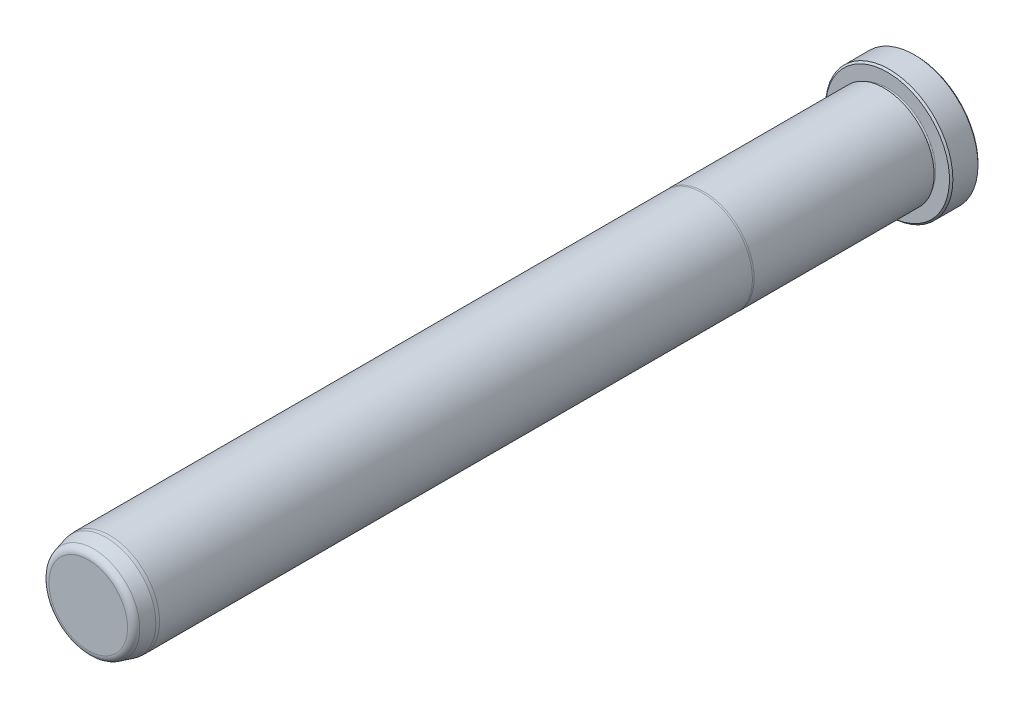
ISO-10303-21;
HEADER;
FILE_DESCRIPTION(('STEP AP214'),'2;1');
FILE_NAME('part.step','',(''),(''),'','','');
FILE_SCHEMA(('AUTOMOTIVE_DESIGN { 1 0 10303 214 1 1 1 1 }'));
ENDSEC;
DATA;
#1=APPLICATION_CONTEXT('core data for automotive mechanical design processes');
#2=APPLICATION_PROTOCOL_DEFINITION('international standard','automotive_design',2000,#1);
#3=PRODUCT_CONTEXT('',#1,'mechanical');
#4=PRODUCT('Part','Part','',(#3));
#5=PRODUCT_RELATED_PRODUCT_CATEGORY('part','',(#4));
#6=PRODUCT_DEFINITION_FORMATION('','',#4);
#7=PRODUCT_DEFINITION_CONTEXT('part definition',#1,'design');
#8=PRODUCT_DEFINITION('design','',#6,#7);
#9=PRODUCT_DEFINITION_SHAPE('','',#8);
#10=(LENGTH_UNIT() NAMED_UNIT(*) SI_UNIT(.MILLI.,.METRE.));
#11=(NAMED_UNIT(*) PLANE_ANGLE_UNIT() SI_UNIT($,.RADIAN.));
#12=(NAMED_UNIT(*) SI_UNIT($,.STERADIAN.) SOLID_ANGLE_UNIT());
#13=UNCERTAINTY_MEASURE_WITH_UNIT(LENGTH_MEASURE(1.E-05),#10,'distance_accuracy_value','');
#14=(GEOMETRIC_REPRESENTATION_CONTEXT(3) GLOBAL_UNCERTAINTY_ASSIGNED_CONTEXT((#13)) GLOBAL_UNIT_ASSIGNED_CONTEXT((#10,
#11,#12)) REPRESENTATION_CONTEXT('',''));
#15=CARTESIAN_POINT('',(0.,0.,0.));
#16=DIRECTION('',(0.,0.,1.));
#17=DIRECTION('',(1.,0.,0.));
#18=AXIS2_PLACEMENT_3D('',#15,#16,#17);
#19=CARTESIAN_POINT('',(0.,0.,0.));
#20=DIRECTION('',(0.,0.,1.));
#21=DIRECTION('',(1.,0.,0.));
#22=AXIS2_PLACEMENT_3D('',#19,#20,#21);
#23=PLANE('',#22);
#24=CARTESIAN_POINT('',(0.,0.,0.));
#25=DIRECTION('',(0.,0.,1.));
#26=DIRECTION('',(1.,0.,0.));
#27=AXIS2_PLACEMENT_3D('',#24,#25,#26);
#28=CIRCLE('',#27,13.7795);
#29=CARTESIAN_POINT('',(13.7795,0.,0.));
#30=VERTEX_POINT('',#29);
#31=EDGE_CURVE('E37',#30,#30,#28,.F.);
#32=ORIENTED_EDGE('',*,*,#31,.T.);
#33=EDGE_LOOP('',(#32));
#34=FACE_BOUND('',#33,.T.);
#35=ADVANCED_FACE('F30',(#34),#23,.F.);
#36=CARTESIAN_POINT('',(0.,0.,0.));
#37=DIRECTION('',(0.,0.,1.));
#38=DIRECTION('',(1.,0.,0.));
#39=AXIS2_PLACEMENT_3D('',#36,#37,#38);
#40=CYLINDRICAL_SURFACE('',#39,14.1605);
#41=CARTESIAN_POINT('',(0.,0.,0.380999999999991));
#42=DIRECTION('',(0.,0.,1.));
#43=DIRECTION('',(1.,0.,0.));
#44=AXIS2_PLACEMENT_3D('',#41,#42,#43);
#45=CIRCLE('',#44,14.1605);
#46=CARTESIAN_POINT('',(14.1605,0.,0.380999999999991));
#47=VERTEX_POINT('',#46);
#48=EDGE_CURVE('E41',#47,#47,#45,.T.);
#49=ORIENTED_EDGE('',*,*,#48,.T.);
#50=EDGE_LOOP('',(#49));
#51=FACE_BOUND('',#50,.T.);
#52=CARTESIAN_POINT('',(0.,0.,5.969));
#53=DIRECTION('',(0.,0.,-1.));
#54=DIRECTION('',(-1.,0.,0.));
#55=AXIS2_PLACEMENT_3D('',#52,#53,#54);
#56=CIRCLE('',#55,14.1605);
#57=CARTESIAN_POINT('',(-14.1605,0.,5.969));
#58=VERTEX_POINT('',#57);
#59=EDGE_CURVE('E45',#58,#58,#56,.T.);
#60=ORIENTED_EDGE('',*,*,#59,.T.);
#61=EDGE_LOOP('',(#60));
#62=FACE_BOUND('',#61,.T.);
#63=ADVANCED_FACE('F118',(#51,#62),#40,.T.);
#64=CARTESIAN_POINT('',(0.,14.1605,6.35));
#65=DIRECTION('',(0.,0.,-1.));
#66=DIRECTION('',(-1.,0.,0.));
#67=AXIS2_PLACEMENT_3D('',#64,#65,#66);
#68=PLANE('',#67);
#69=CARTESIAN_POINT('',(0.,0.,6.35));
#70=DIRECTION('',(0.,0.,-1.));
#71=DIRECTION('',(-1.,0.,0.));
#72=AXIS2_PLACEMENT_3D('',#69,#70,#71);
#73=CIRCLE('',#72,13.7795);
#74=CARTESIAN_POINT('',(-13.7795,0.,6.35));
#75=VERTEX_POINT('',#74);
#76=EDGE_CURVE('E10',#75,#75,#73,.F.);
#77=ORIENTED_EDGE('',*,*,#76,.T.);
#78=EDGE_LOOP('',(#77));
#79=FACE_BOUND('',#78,.T.);
#80=CARTESIAN_POINT('',(0.,0.,6.35));
#81=DIRECTION('',(0.,0.,1.));
#82=DIRECTION('',(1.,0.,0.));
#83=AXIS2_PLACEMENT_3D('',#80,#81,#82);
#84=CIRCLE('',#83,10.7188);
#85=CARTESIAN_POINT('',(10.7188,0.,6.35));
#86=VERTEX_POINT('',#85);
#87=EDGE_CURVE('E56',#86,#86,#84,.T.);
#88=ORIENTED_EDGE('',*,*,#87,.F.);
#89=EDGE_LOOP('',(#88));
#90=FACE_BOUND('',#89,.T.);
#91=ADVANCED_FACE('F113',(#79,#90),#68,.F.);
#92=CARTESIAN_POINT('',(0.,0.,6.731));
#93=DIRECTION('',(0.,0.,1.));
#94=DIRECTION('',(1.,0.,0.));
#95=AXIS2_PLACEMENT_3D('',#92,#93,#94);
#96=TOROIDAL_SURFACE('',#95,10.7188,0.381000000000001);
#97=CARTESIAN_POINT('',(0.,0.,7.112));
#98=DIRECTION('',(0.,0.,1.));
#99=DIRECTION('',(1.,0.,0.));
#100=AXIS2_PLACEMENT_3D('',#97,#98,#99);
#101=CIRCLE('',#100,10.7188);
#102=CARTESIAN_POINT('',(10.7188,0.,7.112));
#103=VERTEX_POINT('',#102);
#104=EDGE_CURVE('E59',#103,#103,#101,.T.);
#105=ORIENTED_EDGE('',*,*,#104,.F.);
#106=EDGE_LOOP('',(#105));
#107=FACE_BOUND('',#106,.T.);
#108=ORIENTED_EDGE('',*,*,#87,.T.);
#109=EDGE_LOOP('',(#108));
#110=FACE_BOUND('',#109,.T.);
#111=ADVANCED_FACE('F107',(#107,#110),#96,.F.);
#112=CARTESIAN_POINT('',(0.,10.7188,7.112));
#113=DIRECTION('',(0.,0.,1.));
#114=DIRECTION('',(1.,0.,0.));
#115=AXIS2_PLACEMENT_3D('',#112,#113,#114);
#116=PLANE('',#115);
#117=CARTESIAN_POINT('',(0.,0.,7.112));
#118=DIRECTION('',(0.,0.,1.));
#119=DIRECTION('',(1.,0.,0.));
#120=AXIS2_PLACEMENT_3D('',#117,#118,#119);
#121=CIRCLE('',#120,11.1252);
#122=CARTESIAN_POINT('',(11.1252,0.,7.112));
#123=VERTEX_POINT('',#122);
#124=EDGE_CURVE('E62',#123,#123,#121,.T.);
#125=ORIENTED_EDGE('',*,*,#124,.F.);
#126=EDGE_LOOP('',(#125));
#127=FACE_BOUND('',#126,.T.);
#128=ORIENTED_EDGE('',*,*,#104,.T.);
#129=EDGE_LOOP('',(#128));
#130=FACE_BOUND('',#129,.T.);
#131=ADVANCED_FACE('F101',(#127,#130),#116,.F.);
#132=CARTESIAN_POINT('',(0.,0.,0.));
#133=DIRECTION('',(0.,0.,1.));
#134=DIRECTION('',(1.,0.,0.));
#135=AXIS2_PLACEMENT_3D('',#132,#133,#134);
#136=CYLINDRICAL_SURFACE('',#135,11.1252);
#137=CARTESIAN_POINT('',(0.,0.,47.1347630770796));
#138=DIRECTION('',(0.,0.,1.));
#139=DIRECTION('',(1.,0.,0.));
#140=AXIS2_PLACEMENT_3D('',#137,#138,#139);
#141=CIRCLE('',#140,11.1252);
#142=CARTESIAN_POINT('',(11.1252,0.,47.1347630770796));
#143=VERTEX_POINT('',#142);
#144=EDGE_CURVE('E65',#143,#143,#141,.T.);
#145=ORIENTED_EDGE('',*,*,#144,.F.);
#146=EDGE_LOOP('',(#145));
#147=FACE_BOUND('',#146,.T.);
#148=ORIENTED_EDGE('',*,*,#124,.T.);
#149=EDGE_LOOP('',(#148));
#150=FACE_BOUND('',#149,.T.);
#151=ADVANCED_FACE('F95',(#147,#150),#136,.T.);
#152=CARTESIAN_POINT('',(0.,0.,47.1347630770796));
#153=DIRECTION('',(0.,0.,-1.));
#154=DIRECTION('',(-1.,0.,0.));
#155=AXIS2_PLACEMENT_3D('',#152,#153,#154);
#156=CONICAL_SURFACE('',#155,11.1252,0.0698131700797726);
#157=CARTESIAN_POINT('',(0.,0.,47.498));
#158=DIRECTION('',(0.,0.,1.));
#159=DIRECTION('',(1.,0.,0.));
#160=AXIS2_PLACEMENT_3D('',#157,#158,#159);
#161=CIRCLE('',#160,11.0998);
#162=CARTESIAN_POINT('',(11.0998,0.,47.498));
#163=VERTEX_POINT('',#162);
#164=EDGE_CURVE('E68',#163,#163,#161,.T.);
#165=ORIENTED_EDGE('',*,*,#164,.F.);
#166=EDGE_LOOP('',(#165));
#167=FACE_BOUND('',#166,.T.);
#168=ORIENTED_EDGE('',*,*,#144,.T.);
#169=EDGE_LOOP('',(#168));
#170=FACE_BOUND('',#169,.T.);
#171=ADVANCED_FACE('F89',(#167,#170),#156,.T.);
#172=CARTESIAN_POINT('',(0.,0.,0.));
#173=DIRECTION('',(0.,0.,1.));
#174=DIRECTION('',(1.,0.,0.));
#175=AXIS2_PLACEMENT_3D('',#172,#173,#174);
#176=CYLINDRICAL_SURFACE('',#175,11.0998);
#177=CARTESIAN_POINT('',(0.,0.,179.3875));
#178=DIRECTION('',(0.,0.,1.));
#179=DIRECTION('',(1.,0.,0.));
#180=AXIS2_PLACEMENT_3D('',#177,#178,#179);
#181=CIRCLE('',#180,11.0998);
#182=CARTESIAN_POINT('',(11.0998,0.,179.3875));
#183=VERTEX_POINT('',#182);
#184=EDGE_CURVE('E71',#183,#183,#181,.T.);
#185=ORIENTED_EDGE('',*,*,#184,.F.);
#186=EDGE_LOOP('',(#185));
#187=FACE_BOUND('',#186,.T.);
#188=ORIENTED_EDGE('',*,*,#164,.T.);
#189=EDGE_LOOP('',(#188));
#190=FACE_BOUND('',#189,.T.);
#191=ADVANCED_FACE('F83',(#187,#190),#176,.T.);
#192=CARTESIAN_POINT('',(0.,0.,179.3875));
#193=DIRECTION('',(0.,0.,-1.));
#194=DIRECTION('',(-1.,0.,0.));
#195=AXIS2_PLACEMENT_3D('',#192,#193,#194);
#196=CONICAL_SURFACE('',#195,11.0998,0.0872664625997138);
#197=CARTESIAN_POINT('',(0.,0.,180.1495));
#198=DIRECTION('',(0.,0.,1.));
#199=DIRECTION('',(1.,0.,0.));
#200=AXIS2_PLACEMENT_3D('',#197,#198,#199);
#201=CIRCLE('',#200,11.0331336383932);
#202=CARTESIAN_POINT('',(11.0331336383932,0.,180.1495));
#203=VERTEX_POINT('',#202);
#204=EDGE_CURVE('E74',#203,#203,#201,.T.);
#205=ORIENTED_EDGE('',*,*,#204,.F.);
#206=EDGE_LOOP('',(#205));
#207=FACE_BOUND('',#206,.T.);
#208=ORIENTED_EDGE('',*,*,#184,.T.);
#209=EDGE_LOOP('',(#208));
#210=FACE_BOUND('',#209,.T.);
#211=ADVANCED_FACE('F80',(#207,#210),#196,.T.);
#212=CARTESIAN_POINT('',(0.,0.,180.1495));
#213=DIRECTION('',(0.,0.,-1.));
#214=DIRECTION('',(-1.,0.,0.));
#215=AXIS2_PLACEMENT_3D('',#212,#213,#214);
#216=CONICAL_SURFACE('',#215,11.0331336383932,0.26179938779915);
#217=CARTESIAN_POINT('',(0.,0.,182.9733752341));
#218=DIRECTION('',(0.,0.,1.));
#219=DIRECTION('',(1.,0.,0.));
#220=AXIS2_PLACEMENT_3D('',#217,#218,#219);
#221=CIRCLE('',#220,10.2764785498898);
#222=CARTESIAN_POINT('',(10.2764785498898,0.,182.9733752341));
#223=VERTEX_POINT('',#222);
#224=EDGE_CURVE('E50',#223,#223,#221,.F.);
#225=ORIENTED_EDGE('',*,*,#224,.T.);
#226=EDGE_LOOP('',(#225));
#227=FACE_BOUND('',#226,.T.);
#228=ORIENTED_EDGE('',*,*,#204,.T.);
#229=EDGE_LOOP('',(#228));
#230=FACE_BOUND('',#229,.T.);
#231=ADVANCED_FACE('F78',(#227,#230),#216,.T.);
#232=CARTESIAN_POINT('',(0.,9.96120289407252,184.15));
#233=DIRECTION('',(0.,0.,-1.));
#234=DIRECTION('',(-1.,0.,0.));
#235=AXIS2_PLACEMENT_3D('',#232,#233,#234);
#236=PLANE('',#235);
#237=CARTESIAN_POINT('',(0.,0.,184.15));
#238=DIRECTION('',(0.,0.,-1.));
#239=DIRECTION('',(-1.,0.,0.));
#240=AXIS2_PLACEMENT_3D('',#237,#238,#239);
#241=CIRCLE('',#240,8.74307130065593);
#242=CARTESIAN_POINT('',(-8.74307130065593,0.,184.15));
#243=VERTEX_POINT('',#242);
#244=EDGE_CURVE('E53',#243,#243,#241,.F.);
#245=ORIENTED_EDGE('',*,*,#244,.T.);
#246=EDGE_LOOP('',(#245));
#247=FACE_BOUND('',#246,.T.);
#248=ADVANCED_FACE('F133',(#247),#236,.F.);
#249=CARTESIAN_POINT('',(0.,0.,182.5625));
#250=DIRECTION('',(0.,0.,-1.));
#251=DIRECTION('',(-1.,0.,0.));
#252=AXIS2_PLACEMENT_3D('',#249,#250,#251);
#253=TOROIDAL_SURFACE('',#252,8.74307130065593,1.5875);
#254=ORIENTED_EDGE('',*,*,#224,.F.);
#255=EDGE_LOOP('',(#254));
#256=FACE_BOUND('',#255,.T.);
#257=ORIENTED_EDGE('',*,*,#244,.F.);
#258=EDGE_LOOP('',(#257));
#259=FACE_BOUND('',#258,.T.);
#260=ADVANCED_FACE('F130',(#256,#259),#253,.T.);
#261=CARTESIAN_POINT('',(0.,0.,0.380999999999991));
#262=DIRECTION('',(0.,0.,1.));
#263=DIRECTION('',(1.,0.,0.));
#264=AXIS2_PLACEMENT_3D('',#261,#262,#263);
#265=CONICAL_SURFACE('',#264,14.1605,0.785398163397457);
#266=ORIENTED_EDGE('',*,*,#31,.F.);
#267=EDGE_LOOP('',(#266));
#268=FACE_BOUND('',#267,.T.);
#269=ORIENTED_EDGE('',*,*,#48,.F.);
#270=EDGE_LOOP('',(#269));
#271=FACE_BOUND('',#270,.T.);
#272=ADVANCED_FACE('F132',(#268,#271),#265,.T.);
#273=CARTESIAN_POINT('',(0.,0.,6.35));
#274=DIRECTION('',(0.,0.,-1.));
#275=DIRECTION('',(-1.,0.,0.));
#276=AXIS2_PLACEMENT_3D('',#273,#274,#275);
#277=CONICAL_SURFACE('',#276,13.7795,0.785398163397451);
#278=ORIENTED_EDGE('',*,*,#59,.F.);
#279=EDGE_LOOP('',(#278));
#280=FACE_BOUND('',#279,.T.);
#281=ORIENTED_EDGE('',*,*,#76,.F.);
#282=EDGE_LOOP('',(#281));
#283=FACE_BOUND('',#282,.T.);
#284=ADVANCED_FACE('F32',(#280,#283),#277,.T.);
#285=CLOSED_SHELL('',(#35,#63,#91,#111,#131,#151,#171,#191,#211,#231,#248,#260,#272,#284));
#286=MANIFOLD_SOLID_BREP('B2',#285);
#287=ADVANCED_BREP_SHAPE_REPRESENTATION('',(#18,#286),#14);
#288=SHAPE_DEFINITION_REPRESENTATION(#9,#287);
ENDSEC;
END-ISO-10303-21;
